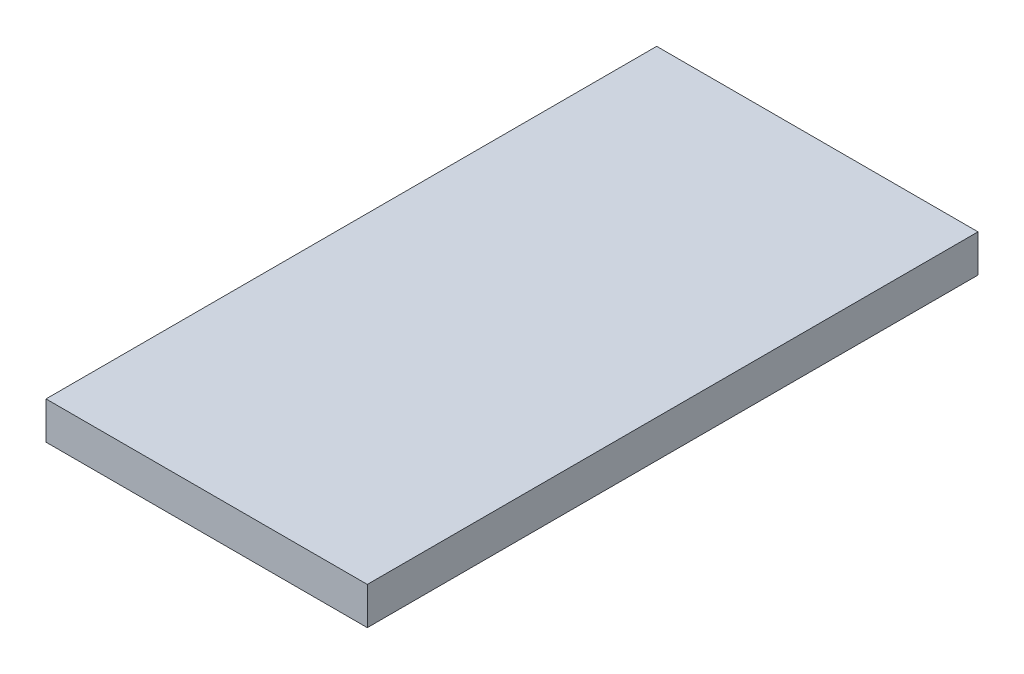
ISO-10303-21;
HEADER;
FILE_DESCRIPTION(('STEP AP214'),'2;1');
FILE_NAME('part.step','',(''),(''),'','','');
FILE_SCHEMA(('AUTOMOTIVE_DESIGN { 1 0 10303 214 1 1 1 1 }'));
ENDSEC;
DATA;
#1=APPLICATION_CONTEXT('core data for automotive mechanical design processes');
#2=APPLICATION_PROTOCOL_DEFINITION('international standard','automotive_design',2000,#1);
#3=PRODUCT_CONTEXT('',#1,'mechanical');
#4=PRODUCT('Part','Part','',(#3));
#5=PRODUCT_RELATED_PRODUCT_CATEGORY('part','',(#4));
#6=PRODUCT_DEFINITION_FORMATION('','',#4);
#7=PRODUCT_DEFINITION_CONTEXT('part definition',#1,'design');
#8=PRODUCT_DEFINITION('design','',#6,#7);
#9=PRODUCT_DEFINITION_SHAPE('','',#8);
#10=(LENGTH_UNIT() NAMED_UNIT(*) SI_UNIT(.MILLI.,.METRE.));
#11=(NAMED_UNIT(*) PLANE_ANGLE_UNIT() SI_UNIT($,.RADIAN.));
#12=(NAMED_UNIT(*) SI_UNIT($,.STERADIAN.) SOLID_ANGLE_UNIT());
#13=UNCERTAINTY_MEASURE_WITH_UNIT(LENGTH_MEASURE(1.E-05),#10,'distance_accuracy_value','');
#14=(GEOMETRIC_REPRESENTATION_CONTEXT(3) GLOBAL_UNCERTAINTY_ASSIGNED_CONTEXT((#13)) GLOBAL_UNIT_ASSIGNED_CONTEXT((#10,
#11,#12)) REPRESENTATION_CONTEXT('',''));
#15=CARTESIAN_POINT('',(0.,0.,0.));
#16=DIRECTION('',(0.,0.,1.));
#17=DIRECTION('',(1.,0.,0.));
#18=AXIS2_PLACEMENT_3D('',#15,#16,#17);
#19=CARTESIAN_POINT('',(0.,0.,0.));
#20=DIRECTION('',(0.,0.,1.));
#21=DIRECTION('',(1.,0.,0.));
#22=AXIS2_PLACEMENT_3D('',#19,#20,#21);
#23=PLANE('',#22);
#24=DIRECTION('',(0.,1.,0.));
#25=VECTOR('',#24,1.);
#26=CARTESIAN_POINT('',(450.000000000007,191.499999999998,0.));
#27=LINE('',#26,#25);
#28=CARTESIAN_POINT('',(450.000000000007,191.499999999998,0.));
#29=VERTEX_POINT('',#28);
#30=CARTESIAN_POINT('',(450.000000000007,218.499999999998,0.));
#31=VERTEX_POINT('',#30);
#32=EDGE_CURVE('E83',#29,#31,#27,.T.);
#33=ORIENTED_EDGE('',*,*,#32,.F.);
#34=DIRECTION('',(1.,0.,0.));
#35=VECTOR('',#34,1.);
#36=CARTESIAN_POINT('',(450.000000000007,191.499999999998,0.));
#37=LINE('',#36,#35);
#38=CARTESIAN_POINT('',(218.499999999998,191.499999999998,0.));
#39=VERTEX_POINT('',#38);
#40=EDGE_CURVE('E94',#39,#29,#37,.T.);
#41=ORIENTED_EDGE('',*,*,#40,.F.);
#42=DIRECTION('',(0.,-1.,0.));
#43=VECTOR('',#42,1.);
#44=CARTESIAN_POINT('',(218.499999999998,191.499999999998,0.));
#45=LINE('',#44,#43);
#46=CARTESIAN_POINT('',(218.499999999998,218.499999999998,0.));
#47=VERTEX_POINT('',#46);
#48=EDGE_CURVE('E85',#47,#39,#45,.T.);
#49=ORIENTED_EDGE('',*,*,#48,.F.);
#50=DIRECTION('',(-1.,0.,0.));
#51=VECTOR('',#50,1.);
#52=CARTESIAN_POINT('',(450.000000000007,218.499999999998,0.));
#53=LINE('',#52,#51);
#54=EDGE_CURVE('E75',#31,#47,#53,.T.);
#55=ORIENTED_EDGE('',*,*,#54,.F.);
#56=EDGE_LOOP('',(#33,#41,#49,#55));
#57=FACE_BOUND('',#56,.T.);
#58=ADVANCED_FACE('F33',(#57),#23,.F.);
#59=CARTESIAN_POINT('',(450.000000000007,191.499999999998,673.069195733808));
#60=DIRECTION('',(0.,1.,0.));
#61=DIRECTION('',(-1.,0.,0.));
#62=AXIS2_PLACEMENT_3D('',#59,#60,#61);
#63=PLANE('',#62);
#64=DIRECTION('',(0.,0.,-1.));
#65=VECTOR('',#64,1.);
#66=CARTESIAN_POINT('',(450.000000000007,191.499999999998,673.069195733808));
#67=LINE('',#66,#65);
#68=CARTESIAN_POINT('',(450.000000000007,191.499999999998,440.));
#69=VERTEX_POINT('',#68);
#70=EDGE_CURVE('E88',#69,#29,#67,.T.);
#71=ORIENTED_EDGE('',*,*,#70,.F.);
#72=DIRECTION('',(-1.,0.,0.));
#73=VECTOR('',#72,1.);
#74=CARTESIAN_POINT('',(450.000000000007,191.499999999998,440.));
#75=LINE('',#74,#73);
#76=CARTESIAN_POINT('',(218.499999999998,191.499999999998,440.));
#77=VERTEX_POINT('',#76);
#78=EDGE_CURVE('E37',#69,#77,#75,.T.);
#79=ORIENTED_EDGE('',*,*,#78,.T.);
#80=DIRECTION('',(0.,0.,-1.));
#81=VECTOR('',#80,1.);
#82=CARTESIAN_POINT('',(218.499999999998,191.499999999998,673.069195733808));
#83=LINE('',#82,#81);
#84=EDGE_CURVE('E97',#77,#39,#83,.T.);
#85=ORIENTED_EDGE('',*,*,#84,.T.);
#86=ORIENTED_EDGE('',*,*,#40,.T.);
#87=EDGE_LOOP('',(#71,#79,#85,#86));
#88=FACE_BOUND('',#87,.T.);
#89=ADVANCED_FACE('F106',(#88),#63,.F.);
#90=CARTESIAN_POINT('',(218.499999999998,191.499999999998,673.069195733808));
#91=DIRECTION('',(1.,0.,0.));
#92=DIRECTION('',(0.,0.,-1.));
#93=AXIS2_PLACEMENT_3D('',#90,#91,#92);
#94=PLANE('',#93);
#95=ORIENTED_EDGE('',*,*,#84,.F.);
#96=DIRECTION('',(0.,1.,0.));
#97=VECTOR('',#96,1.);
#98=CARTESIAN_POINT('',(218.499999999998,191.499999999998,440.));
#99=LINE('',#98,#97);
#100=CARTESIAN_POINT('',(218.499999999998,218.499999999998,440.));
#101=VERTEX_POINT('',#100);
#102=EDGE_CURVE('E103',#77,#101,#99,.T.);
#103=ORIENTED_EDGE('',*,*,#102,.T.);
#104=DIRECTION('',(0.,0.,-1.));
#105=VECTOR('',#104,1.);
#106=CARTESIAN_POINT('',(218.499999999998,218.499999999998,673.069195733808));
#107=LINE('',#106,#105);
#108=EDGE_CURVE('E79',#101,#47,#107,.T.);
#109=ORIENTED_EDGE('',*,*,#108,.T.);
#110=ORIENTED_EDGE('',*,*,#48,.T.);
#111=EDGE_LOOP('',(#95,#103,#109,#110));
#112=FACE_BOUND('',#111,.T.);
#113=ADVANCED_FACE('F102',(#112),#94,.F.);
#114=CARTESIAN_POINT('',(450.000000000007,218.499999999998,673.069195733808));
#115=DIRECTION('',(0.,-1.,0.));
#116=DIRECTION('',(1.,0.,0.));
#117=AXIS2_PLACEMENT_3D('',#114,#115,#116);
#118=PLANE('',#117);
#119=ORIENTED_EDGE('',*,*,#108,.F.);
#120=DIRECTION('',(1.,0.,0.));
#121=VECTOR('',#120,1.);
#122=CARTESIAN_POINT('',(450.000000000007,218.499999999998,440.));
#123=LINE('',#122,#121);
#124=CARTESIAN_POINT('',(450.000000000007,218.499999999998,440.));
#125=VERTEX_POINT('',#124);
#126=EDGE_CURVE('E42',#101,#125,#123,.T.);
#127=ORIENTED_EDGE('',*,*,#126,.T.);
#128=DIRECTION('',(0.,0.,-1.));
#129=VECTOR('',#128,1.);
#130=CARTESIAN_POINT('',(450.000000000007,218.499999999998,673.069195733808));
#131=LINE('',#130,#129);
#132=EDGE_CURVE('E72',#125,#31,#131,.T.);
#133=ORIENTED_EDGE('',*,*,#132,.T.);
#134=ORIENTED_EDGE('',*,*,#54,.T.);
#135=EDGE_LOOP('',(#119,#127,#133,#134));
#136=FACE_BOUND('',#135,.T.);
#137=ADVANCED_FACE('F74',(#136),#118,.F.);
#138=CARTESIAN_POINT('',(450.000000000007,191.499999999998,673.069195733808));
#139=DIRECTION('',(-1.,0.,0.));
#140=DIRECTION('',(0.,0.,1.));
#141=AXIS2_PLACEMENT_3D('',#138,#139,#140);
#142=PLANE('',#141);
#143=ORIENTED_EDGE('',*,*,#132,.F.);
#144=DIRECTION('',(0.,-1.,0.));
#145=VECTOR('',#144,1.);
#146=CARTESIAN_POINT('',(450.000000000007,191.499999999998,440.));
#147=LINE('',#146,#145);
#148=EDGE_CURVE('E11',#125,#69,#147,.T.);
#149=ORIENTED_EDGE('',*,*,#148,.T.);
#150=ORIENTED_EDGE('',*,*,#70,.T.);
#151=ORIENTED_EDGE('',*,*,#32,.T.);
#152=EDGE_LOOP('',(#143,#149,#150,#151));
#153=FACE_BOUND('',#152,.T.);
#154=ADVANCED_FACE('F35',(#153),#142,.F.);
#155=CARTESIAN_POINT('',(0.,0.,440.));
#156=DIRECTION('',(0.,0.,-1.));
#157=DIRECTION('',(-1.,0.,0.));
#158=AXIS2_PLACEMENT_3D('',#155,#156,#157);
#159=PLANE('',#158);
#160=ORIENTED_EDGE('',*,*,#126,.F.);
#161=ORIENTED_EDGE('',*,*,#102,.F.);
#162=ORIENTED_EDGE('',*,*,#78,.F.);
#163=ORIENTED_EDGE('',*,*,#148,.F.);
#164=EDGE_LOOP('',(#160,#161,#162,#163));
#165=FACE_BOUND('',#164,.T.);
#166=ADVANCED_FACE('F120',(#165),#159,.F.);
#167=CLOSED_SHELL('',(#58,#89,#113,#137,#154,#166));
#168=MANIFOLD_SOLID_BREP('B2',#167);
#169=ADVANCED_BREP_SHAPE_REPRESENTATION('',(#18,#168),#14);
#170=SHAPE_DEFINITION_REPRESENTATION(#9,#169);
ENDSEC;
END-ISO-10303-21;
